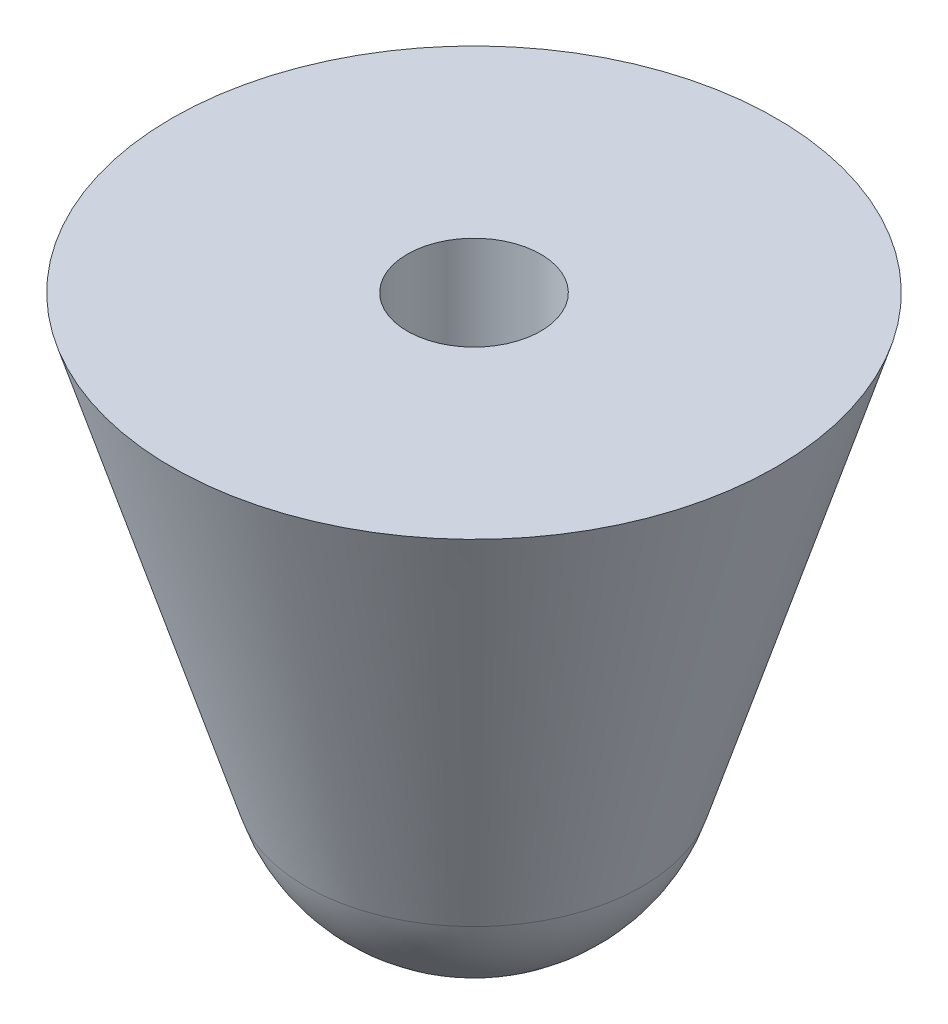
ISO-10303-21;
HEADER;
FILE_DESCRIPTION(('STEP AP214'),'2;1');
FILE_NAME('part.step','',(''),(''),'','','');
FILE_SCHEMA(('AUTOMOTIVE_DESIGN { 1 0 10303 214 1 1 1 1 }'));
ENDSEC;
DATA;
#1=APPLICATION_CONTEXT('core data for automotive mechanical design processes');
#2=APPLICATION_PROTOCOL_DEFINITION('international standard','automotive_design',2000,#1);
#3=PRODUCT_CONTEXT('',#1,'mechanical');
#4=PRODUCT('Part','Part','',(#3));
#5=PRODUCT_RELATED_PRODUCT_CATEGORY('part','',(#4));
#6=PRODUCT_DEFINITION_FORMATION('','',#4);
#7=PRODUCT_DEFINITION_CONTEXT('part definition',#1,'design');
#8=PRODUCT_DEFINITION('design','',#6,#7);
#9=PRODUCT_DEFINITION_SHAPE('','',#8);
#10=(LENGTH_UNIT() NAMED_UNIT(*) SI_UNIT(.MILLI.,.METRE.));
#11=(NAMED_UNIT(*) PLANE_ANGLE_UNIT() SI_UNIT($,.RADIAN.));
#12=(NAMED_UNIT(*) SI_UNIT($,.STERADIAN.) SOLID_ANGLE_UNIT());
#13=UNCERTAINTY_MEASURE_WITH_UNIT(LENGTH_MEASURE(1.E-05),#10,'distance_accuracy_value','');
#14=(GEOMETRIC_REPRESENTATION_CONTEXT(3) GLOBAL_UNCERTAINTY_ASSIGNED_CONTEXT((#13)) GLOBAL_UNIT_ASSIGNED_CONTEXT((#10,
#11,#12)) REPRESENTATION_CONTEXT('',''));
#15=CARTESIAN_POINT('',(0.,0.,0.));
#16=DIRECTION('',(0.,0.,1.));
#17=DIRECTION('',(1.,0.,0.));
#18=AXIS2_PLACEMENT_3D('',#15,#16,#17);
#19=CARTESIAN_POINT('',(0.,0.,0.));
#20=DIRECTION('',(0.,1.,0.));
#21=DIRECTION('',(-1.,0.,0.));
#22=AXIS2_PLACEMENT_3D('',#19,#20,#21);
#23=PLANE('',#22);
#24=CARTESIAN_POINT('',(0.,0.,0.));
#25=DIRECTION('',(0.,1.,0.));
#26=DIRECTION('',(-1.,0.,0.));
#27=AXIS2_PLACEMENT_3D('',#24,#25,#26);
#28=CIRCLE('',#27,1.325);
#29=CARTESIAN_POINT('',(-1.325,0.,0.));
#30=VERTEX_POINT('',#29);
#31=EDGE_CURVE('E58',#30,#30,#28,.T.);
#32=ORIENTED_EDGE('',*,*,#31,.F.);
#33=EDGE_LOOP('',(#32));
#34=FACE_BOUND('',#33,.T.);
#35=CARTESIAN_POINT('',(0.,0.,0.));
#36=DIRECTION('',(0.,1.,0.));
#37=DIRECTION('',(-1.,0.,0.));
#38=AXIS2_PLACEMENT_3D('',#35,#36,#37);
#39=CIRCLE('',#38,6.);
#40=CARTESIAN_POINT('',(-6.,0.,0.));
#41=VERTEX_POINT('',#40);
#42=EDGE_CURVE('E10',#41,#41,#39,.T.);
#43=ORIENTED_EDGE('',*,*,#42,.T.);
#44=EDGE_LOOP('',(#43));
#45=FACE_BOUND('',#44,.T.);
#46=ADVANCED_FACE('F41',(#34,#45),#23,.T.);
#47=CARTESIAN_POINT('',(0.,0.,0.));
#48=DIRECTION('',(0.,1.,0.));
#49=DIRECTION('',(-1.,0.,0.));
#50=AXIS2_PLACEMENT_3D('',#47,#48,#49);
#51=CONICAL_SURFACE('',#50,6.,0.30174667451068);
#52=CARTESIAN_POINT('',(0.,-8.5401594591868,0.));
#53=DIRECTION('',(0.,1.,0.));
#54=DIRECTION('',(-1.,0.,0.));
#55=AXIS2_PLACEMENT_3D('',#52,#53,#54);
#56=CIRCLE('',#55,3.34186599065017);
#57=CARTESIAN_POINT('',(-3.34186599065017,-8.5401594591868,0.));
#58=VERTEX_POINT('',#57);
#59=EDGE_CURVE('E48',#58,#58,#56,.T.);
#60=ORIENTED_EDGE('',*,*,#59,.T.);
#61=EDGE_LOOP('',(#60));
#62=FACE_BOUND('',#61,.T.);
#63=ORIENTED_EDGE('',*,*,#42,.F.);
#64=EDGE_LOOP('',(#63));
#65=FACE_BOUND('',#64,.T.);
#66=ADVANCED_FACE('F68',(#62,#65),#51,.T.);
#67=CARTESIAN_POINT('',(0.,-7.5,0.));
#68=DIRECTION('',(0.,1.,0.));
#69=DIRECTION('',(-1.,0.,0.));
#70=AXIS2_PLACEMENT_3D('',#67,#68,#69);
#71=SPHERICAL_SURFACE('',#70,3.5);
#72=ORIENTED_EDGE('',*,*,#59,.F.);
#73=EDGE_LOOP('',(#72));
#74=FACE_BOUND('',#73,.T.);
#75=ADVANCED_FACE('F72',(#74),#71,.T.);
#76=CARTESIAN_POINT('',(0.,-10.,0.));
#77=DIRECTION('',(0.,1.,0.));
#78=DIRECTION('',(-1.,0.,0.));
#79=AXIS2_PLACEMENT_3D('',#76,#77,#78);
#80=CYLINDRICAL_SURFACE('',#79,1.325);
#81=CARTESIAN_POINT('',(0.,-10.,0.));
#82=DIRECTION('',(0.,1.,0.));
#83=DIRECTION('',(-1.,0.,0.));
#84=AXIS2_PLACEMENT_3D('',#81,#82,#83);
#85=CIRCLE('',#84,1.325);
#86=CARTESIAN_POINT('',(-1.325,-10.,0.));
#87=VERTEX_POINT('',#86);
#88=EDGE_CURVE('E53',#87,#87,#85,.T.);
#89=ORIENTED_EDGE('',*,*,#88,.F.);
#90=EDGE_LOOP('',(#89));
#91=FACE_BOUND('',#90,.T.);
#92=ORIENTED_EDGE('',*,*,#31,.T.);
#93=EDGE_LOOP('',(#92));
#94=FACE_BOUND('',#93,.T.);
#95=ADVANCED_FACE('F65',(#91,#94),#80,.F.);
#96=CARTESIAN_POINT('',(0.,-10.,0.));
#97=DIRECTION('',(0.,1.,0.));
#98=DIRECTION('',(-1.,0.,0.));
#99=AXIS2_PLACEMENT_3D('',#96,#97,#98);
#100=PLANE('',#99);
#101=ORIENTED_EDGE('',*,*,#88,.T.);
#102=EDGE_LOOP('',(#101));
#103=FACE_BOUND('',#102,.T.);
#104=ADVANCED_FACE('F82',(#103),#100,.T.);
#105=CLOSED_SHELL('',(#46,#66,#75,#95,#104));
#106=MANIFOLD_SOLID_BREP('B2',#105);
#107=ADVANCED_BREP_SHAPE_REPRESENTATION('',(#18,#106),#14);
#108=SHAPE_DEFINITION_REPRESENTATION(#9,#107);
ENDSEC;
END-ISO-10303-21;
